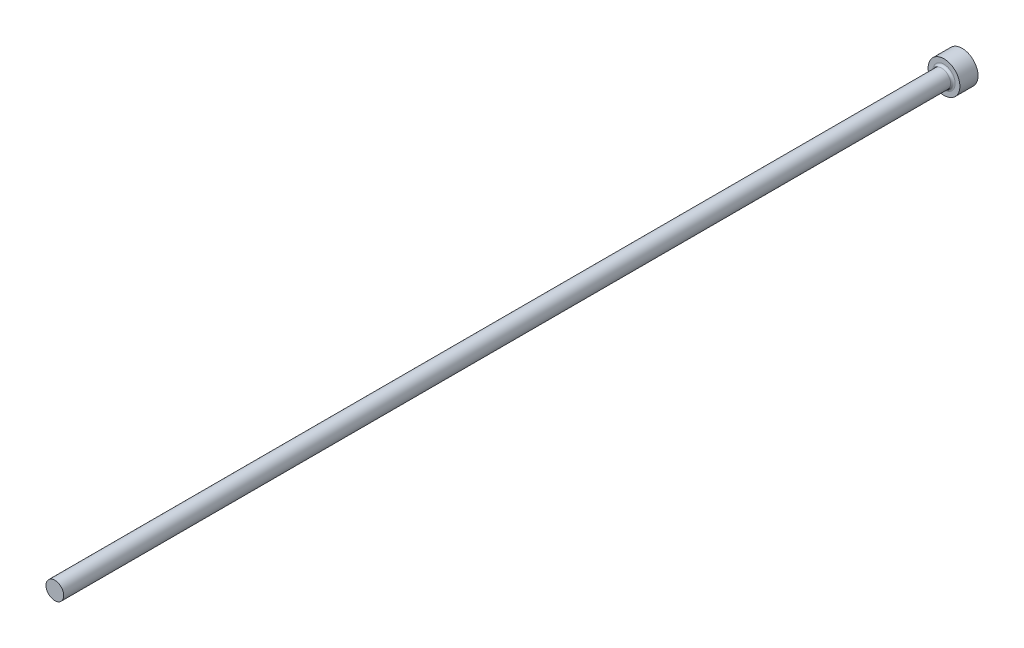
from build123d import *

# Parameters (mm, degrees)
FILLET1_R = 0.5


with BuildPart() as part:
    # FV → Revolve1 (revolve)
    with BuildSketch(Plane(origin=(0, 0, 0), x_dir=(1, 0, 0), z_dir=(0, 1, 0)), mode=Mode.PRIVATE) as revolve1_sk:
        Polygon((0, 0), (3.5, 0), (3.5, -4), (1.95, -4), (1.95, -200), (0, -200), align=None)
    revolve(revolve1_sk.sketch.rotate(Axis((0, 0, -9.033228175), (0, 0, 1)), 180), axis=Axis((0, 0, -9.033228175), (0, 0, 1)))

    # Fillet1
    fillet1_edges = [part.edges().sort_by_distance(p)[0] for p in [
        (1.95, 0, 4),
    ]]
    fillet(fillet1_edges, radius=FILLET1_R)


solid = part.part
